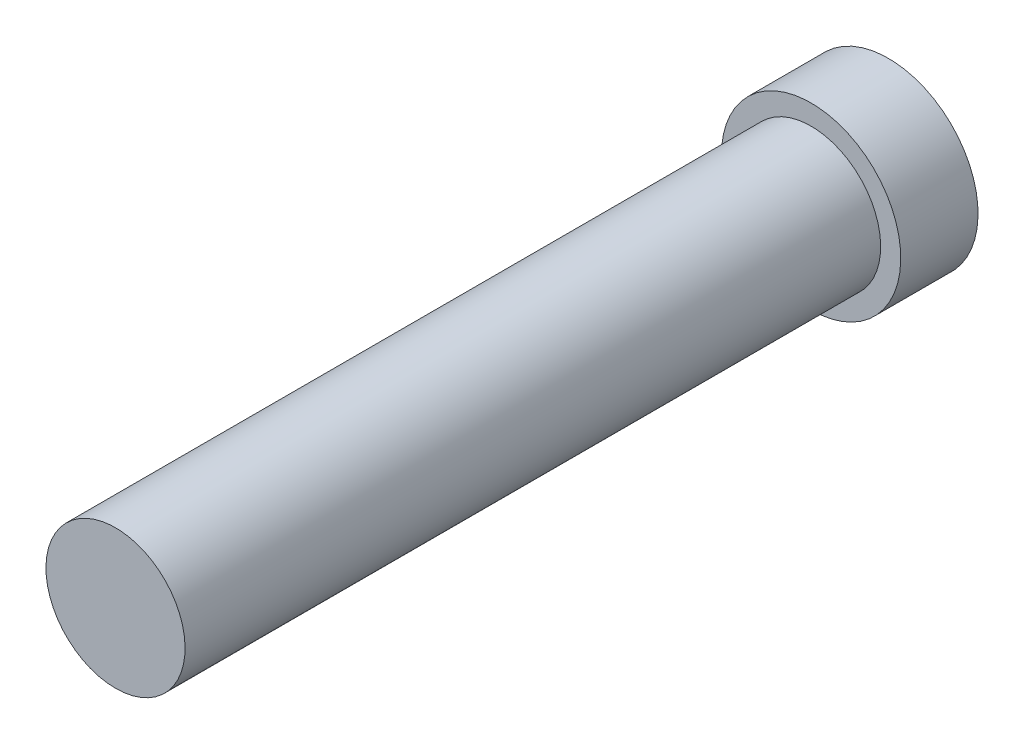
from build123d import *

# Parameters (mm, degrees)
CUT_EXTRUDE1_DEPTH = 3
FILLET1_R          = 0.1
FILLET2_R          = 0.1


with BuildPart() as part:
    # Sketch2 → Revolve1 (revolve)
    with BuildSketch(Plane(origin=(0, 0, 0), x_dir=(0, 0, -1), z_dir=(1, 0, 0)), mode=Mode.PRIVATE) as revolve1_sk:
        Polygon((25, 0), (25, 5.8), (20, 5.8), (20, 4.5), (-25, 4.5), (-25, 0), align=None)
    revolve(revolve1_sk.sketch.rotate(Axis((0, 0, 25), (0, 0, -1)), 180), axis=Axis((0, 0, 25), (0, 0, -1)))

    # Sketch3 → Cut-Extrude1 (cut)
    with BuildSketch(Plane(origin=(0, 0, -25), x_dir=(-1, 0, 0), z_dir=(0, 0, -1))):
        Polygon((0, 3), (2.598076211, 1.5), (2.598076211, -1.5), (0, -3), (-2.598076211, -1.5), (-2.598076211, 1.5), align=None)
    extrude(amount=-CUT_EXTRUDE1_DEPTH, mode=Mode.SUBTRACT)

    # Fillet1
    fillet1_edges = [part.edges().sort_by_distance(p)[0] for p in [
        (-2.598076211, 0, -25),
        (-1.299038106, 2.25, -25),
        (1.299038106, 2.25, -25),
        (2.598076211, 0, -25),
        (1.299038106, -2.25, -25),
        (-1.299038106, -2.25, -25),
    ]]
    fillet(fillet1_edges, radius=FILLET1_R)

    # Fillet2
    fillet2_edges = [part.edges().sort_by_distance(p)[0] for p in [
        (-2.598076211, 0, -22),
        (-1.299038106, -2.25, -22),
        (1.299038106, -2.25, -22),
        (2.598076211, 0, -22),
        (1.299038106, 2.25, -22),
        (-1.299038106, 2.25, -22),
    ]]
    fillet(fillet2_edges, radius=FILLET2_R)


solid = part.part
